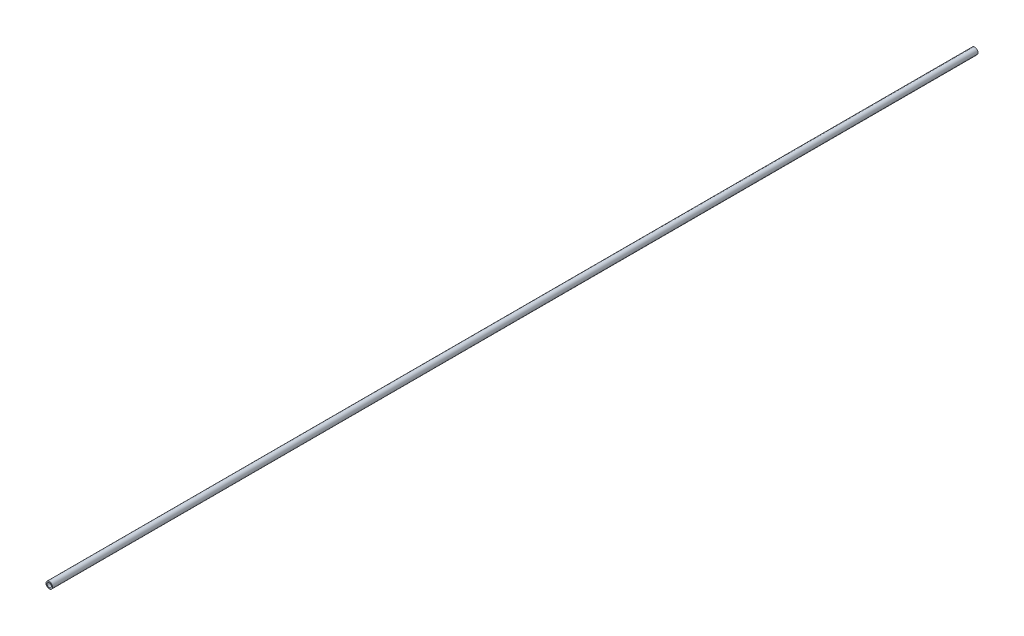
from build123d import *

# Parameters (mm, degrees)
PIPESKETCH_R    = 10.668
PIPESKETCH_R_2  = 6.9342
EXTRUSION_DEPTH = 3048


with BuildPart() as part:
    # PipeSketch → Extrusion (new body)
    with BuildSketch(Plane.XY):
        Circle(PIPESKETCH_R)
        Circle(PIPESKETCH_R_2, mode=Mode.SUBTRACT)
    extrude(amount=EXTRUSION_DEPTH)


solid = part.part
